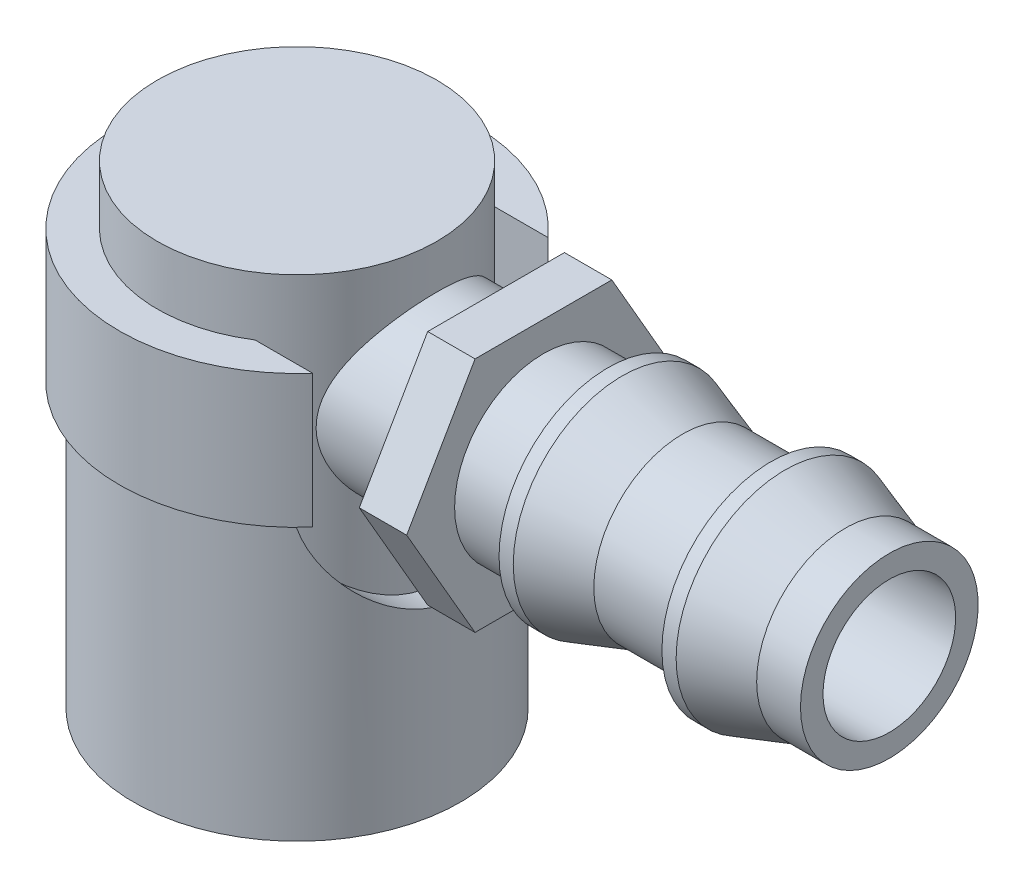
from build123d import *

# Parameters (mm, degrees)
BOSS_EXTRUDE1_DEPTH = 2.54
CUT_EXTRUDE1_REACH  = 44.99
SKETCH5_R           = 3.556
SKETCH7_R           = 8.763
SKETCH7_R_2         = 7.493
BOSS_EXTRUDE2_DEPTH = 15.113
SKETCH8_R           = 6.35
CUT_EXTRUDE3_DEPTH  = 15.113
BOSS_EXTRUDE3_DEPTH = 7.14375
SKETCH10_W          = 1.4859
SKETCH10_H          = 4.445


with BuildPart() as part:
    # Sketch2 → Revolve1 (revolve)
    with BuildSketch(Plane.XY, mode=Mode.PRIVATE) as revolve1_sk:
        Polygon((0, 15.875), (7.493, 15.875), (7.493, -9.525), (4.7625, -9.525), (4.7625, -1.397), (5.0546, -1.228355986), (5.0546, 3.175), (3.5687, 3.175), (3.5687, 13.1445), (0, 13.1445), align=None)
    revolve(revolve1_sk.sketch.rotate(Axis((0, 0, 0), (0, 1, 0)), 90), axis=Axis((0, 0, 0), (0, 1, 0)))

    # Sketch3 → Revolve2 (revolve)
    with BuildSketch(Plane.XY, mode=Mode.PRIVATE) as revolve2_sk:
        Polygon((5.08, 12.319), (5.08, 13.5255), (16.66875, 13.5255), (16.66875, 14.605), (17.43075, 14.605), (20.66925, 13.5255), (25.4, 13.5255), (25.4, 14.605), (26.162, 14.605), (29.4005, 13.5255), (31.75, 13.5255), (31.75, 12.319), align=None)
    revolve(revolve2_sk.sketch.rotate(Axis((-48.315471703, 8.763, 0), (1, 0, 0)), 90), axis=Axis((-48.315471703, 8.763, 0), (1, 0, 0)))

    # Sketch4 → Boss-Extrude1 (add)
    with BuildSketch(Plane(origin=(13.208, 0, 0), x_dir=(0, 0, -1), z_dir=(1, 0, 0))):
        Polygon((7.332348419, 8.763), (3.666174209, 15.113), (-3.666174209, 15.113), (-7.332348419, 8.763), (-3.666174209, 2.413), (3.666174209, 2.413), align=None)
    extrude(amount=-BOSS_EXTRUDE1_DEPTH)

    # Sketch5 → Cut-Extrude1 (cut, up to next)
    with BuildSketch(Plane(origin=(31.75, 0, 0), x_dir=(0, 0, -1), z_dir=(1, 0, 0)), mode=Mode.PRIVATE) as cut_extrude1_sk1:
        with Locations(Location((0, 8.763, 0), (0, 0, 180))):
            Circle(SKETCH5_R)
    cut_extrude1_tool1 = extrude(cut_extrude1_sk1.sketch, amount=-CUT_EXTRUDE1_REACH, mode=Mode.PRIVATE) & part.part
    add(cut_extrude1_tool1.solids().sort_by_distance((31.75, 8.763, 0))[0], mode=Mode.SUBTRACT)
    add(cut_extrude1_tool1.solids().sort_by_distance((31.75, 8.763, 0))[1], mode=Mode.SUBTRACT)



with BuildPart() as body_2:
    # Sketch7 → Boss-Extrude2 (new body)
    with BuildSketch(Plane.XZ.offset(9.525)):
        with Locations(Location((0, 0, 0), (0, 0, 270))):
            Circle(SKETCH7_R)
        with Locations(Location((0, 0, 0), (0, 0, 270))):
            Circle(SKETCH7_R_2, mode=Mode.SUBTRACT)
    extrude(amount=-BOSS_EXTRUDE2_DEPTH)

    # Sketch8 → Cut-Extrude3 (cut)
    with BuildSketch(Plane(origin=(0, 0, 0), x_dir=(0, 0, -1), z_dir=(1, 0, 0))):
        with Locations((0, 6.35)):
            Circle(SKETCH8_R)
    extrude(amount=CUT_EXTRUDE3_DEPTH, mode=Mode.SUBTRACT)


with BuildPart() as part_1:
    add(part.part)

    add(body_2.part)  # Boss-Extrude3 merges body 2
    # Sketch9 → Boss-Extrude3 (add)
    with BuildSketch(Plane(origin=(0, 5.588, 0), x_dir=(1, 0, 0), z_dir=(0, 1, 0))):
        with BuildLine():
            Line((4.050085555, 6.304114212), (7.140291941, 6.304114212))
            ThreePointArc((7.140291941, 6.304114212), (-9.525, 0), (7.140291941, -6.304114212))
            Line((7.140291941, -6.304114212), (4.050085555, -6.304114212))
            ThreePointArc((4.050085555, -6.304114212), (-7.493, 0), (4.050085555, 6.304114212))
        make_face()
    extrude(amount=BOSS_EXTRUDE3_DEPTH)


with BuildPart() as body_2_2:
    # Sketch10 → SC200S-V (revolve)
    with BuildSketch(Plane.XY, mode=Mode.PRIVATE) as sc200s_v_sk:
        with Locations((-4.31165, 0.9525)):
            Rectangle(SKETCH10_W, SKETCH10_H)
    revolve(sc200s_v_sk.sketch.rotate(Axis((0, 3.912096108, 0), (0, -1, 0)), 270), axis=Axis((0, 3.912096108, 0), (0, -1, 0)))


solid = Compound([part_1.part, body_2_2.part])
